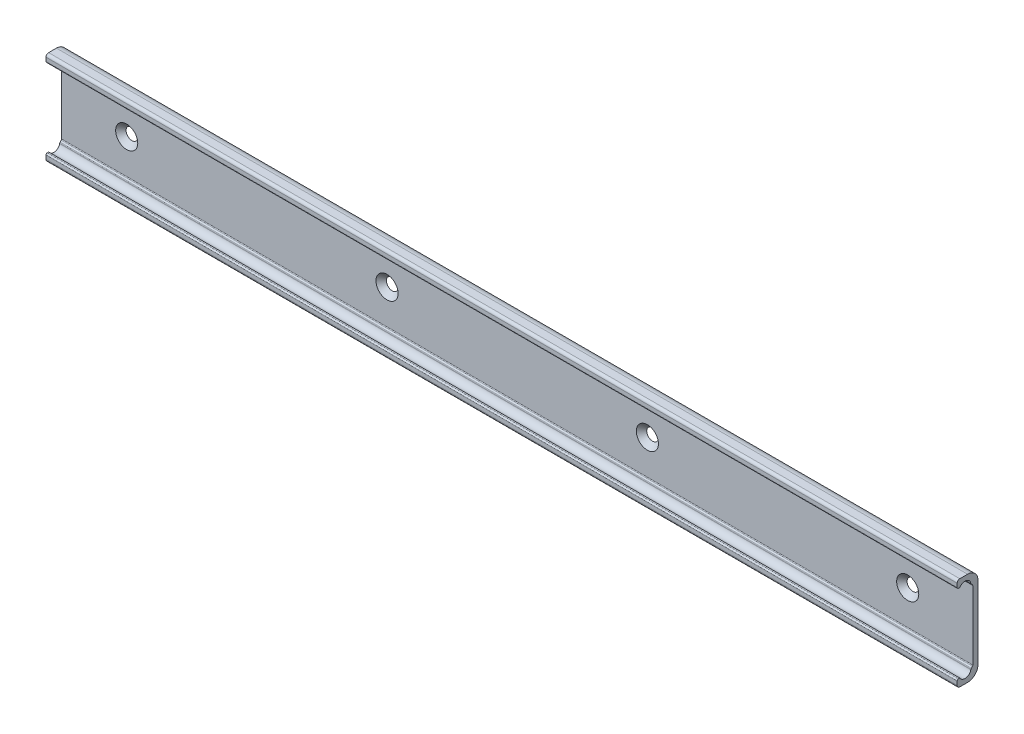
ISO-10303-21;
HEADER;
FILE_DESCRIPTION(('STEP AP214'),'2;1');
FILE_NAME('part.step','',(''),(''),'','','');
FILE_SCHEMA(('AUTOMOTIVE_DESIGN { 1 0 10303 214 1 1 1 1 }'));
ENDSEC;
DATA;
#1=APPLICATION_CONTEXT('core data for automotive mechanical design processes');
#2=APPLICATION_PROTOCOL_DEFINITION('international standard','automotive_design',2000,#1);
#3=PRODUCT_CONTEXT('',#1,'mechanical');
#4=PRODUCT('Part','Part','',(#3));
#5=PRODUCT_RELATED_PRODUCT_CATEGORY('part','',(#4));
#6=PRODUCT_DEFINITION_FORMATION('','',#4);
#7=PRODUCT_DEFINITION_CONTEXT('part definition',#1,'design');
#8=PRODUCT_DEFINITION('design','',#6,#7);
#9=PRODUCT_DEFINITION_SHAPE('','',#8);
#10=(LENGTH_UNIT() NAMED_UNIT(*) SI_UNIT(.MILLI.,.METRE.));
#11=(NAMED_UNIT(*) PLANE_ANGLE_UNIT() SI_UNIT($,.RADIAN.));
#12=(NAMED_UNIT(*) SI_UNIT($,.STERADIAN.) SOLID_ANGLE_UNIT());
#13=UNCERTAINTY_MEASURE_WITH_UNIT(LENGTH_MEASURE(1.E-05),#10,'distance_accuracy_value','');
#14=(GEOMETRIC_REPRESENTATION_CONTEXT(3) GLOBAL_UNCERTAINTY_ASSIGNED_CONTEXT((#13)) GLOBAL_UNIT_ASSIGNED_CONTEXT((#10,
#11,#12)) REPRESENTATION_CONTEXT('',''));
#15=CARTESIAN_POINT('',(0.,0.,0.));
#16=DIRECTION('',(0.,0.,1.));
#17=DIRECTION('',(1.,0.,0.));
#18=AXIS2_PLACEMENT_3D('',#15,#16,#17);
#19=CARTESIAN_POINT('',(325.,14.,4.));
#20=DIRECTION('',(-1.,0.,0.));
#21=DIRECTION('',(0.,0.,1.));
#22=AXIS2_PLACEMENT_3D('',#19,#20,#21);
#23=CYLINDRICAL_SURFACE('',#22,4.);
#24=CARTESIAN_POINT('',(-25.,14.,4.));
#25=DIRECTION('',(-1.,0.,0.));
#26=DIRECTION('',(0.,0.,1.));
#27=AXIS2_PLACEMENT_3D('',#24,#25,#26);
#28=CIRCLE('',#27,4.);
#29=CARTESIAN_POINT('',(-25.,18.,4.));
#30=VERTEX_POINT('',#29);
#31=CARTESIAN_POINT('',(-25.,14.,0.));
#32=VERTEX_POINT('',#31);
#33=EDGE_CURVE('E174',#30,#32,#28,.T.);
#34=ORIENTED_EDGE('',*,*,#33,.F.);
#35=DIRECTION('',(-1.,0.,0.));
#36=VECTOR('',#35,1.);
#37=CARTESIAN_POINT('',(325.,18.,4.));
#38=LINE('',#37,#36);
#39=CARTESIAN_POINT('',(325.,18.,4.));
#40=VERTEX_POINT('',#39);
#41=EDGE_CURVE('E9',#40,#30,#38,.T.);
#42=ORIENTED_EDGE('',*,*,#41,.F.);
#43=CARTESIAN_POINT('',(325.,14.,4.));
#44=DIRECTION('',(-1.,0.,0.));
#45=DIRECTION('',(0.,0.,1.));
#46=AXIS2_PLACEMENT_3D('',#43,#44,#45);
#47=CIRCLE('',#46,4.);
#48=CARTESIAN_POINT('',(325.,14.,0.));
#49=VERTEX_POINT('',#48);
#50=EDGE_CURVE('E176',#40,#49,#47,.T.);
#51=ORIENTED_EDGE('',*,*,#50,.T.);
#52=DIRECTION('',(-1.,0.,0.));
#53=VECTOR('',#52,1.);
#54=CARTESIAN_POINT('',(325.,14.,0.));
#55=LINE('',#54,#53);
#56=EDGE_CURVE('E17',#49,#32,#55,.T.);
#57=ORIENTED_EDGE('',*,*,#56,.T.);
#58=EDGE_LOOP('',(#34,#42,#51,#57));
#59=FACE_BOUND('',#58,.T.);
#60=ADVANCED_FACE('F14',(#59),#23,.T.);
#61=CARTESIAN_POINT('',(325.,18.,7.));
#62=DIRECTION('',(0.,1.,0.));
#63=DIRECTION('',(-1.,0.,0.));
#64=AXIS2_PLACEMENT_3D('',#61,#62,#63);
#65=PLANE('',#64);
#66=DIRECTION('',(0.,0.,-1.));
#67=VECTOR('',#66,1.);
#68=CARTESIAN_POINT('',(-25.,18.,7.));
#69=LINE('',#68,#67);
#70=CARTESIAN_POINT('',(-25.,18.,7.));
#71=VERTEX_POINT('',#70);
#72=EDGE_CURVE('E192',#71,#30,#69,.T.);
#73=ORIENTED_EDGE('',*,*,#72,.F.);
#74=DIRECTION('',(-1.,0.,0.));
#75=VECTOR('',#74,1.);
#76=CARTESIAN_POINT('',(325.,18.,7.));
#77=LINE('',#76,#75);
#78=CARTESIAN_POINT('',(325.,18.,7.));
#79=VERTEX_POINT('',#78);
#80=EDGE_CURVE('E22',#79,#71,#77,.T.);
#81=ORIENTED_EDGE('',*,*,#80,.F.);
#82=DIRECTION('',(0.,0.,-1.));
#83=VECTOR('',#82,1.);
#84=CARTESIAN_POINT('',(325.,18.,7.));
#85=LINE('',#84,#83);
#86=EDGE_CURVE('E181',#79,#40,#85,.T.);
#87=ORIENTED_EDGE('',*,*,#86,.T.);
#88=ORIENTED_EDGE('',*,*,#41,.T.);
#89=EDGE_LOOP('',(#73,#81,#87,#88));
#90=FACE_BOUND('',#89,.T.);
#91=ADVANCED_FACE('F448',(#90),#65,.T.);
#92=CARTESIAN_POINT('',(325.,17.,7.));
#93=DIRECTION('',(-1.,0.,0.));
#94=DIRECTION('',(0.,0.,1.));
#95=AXIS2_PLACEMENT_3D('',#92,#93,#94);
#96=CYLINDRICAL_SURFACE('',#95,1.);
#97=CARTESIAN_POINT('',(-25.,17.,7.));
#98=DIRECTION('',(-1.,0.,0.));
#99=DIRECTION('',(0.,0.,1.));
#100=AXIS2_PLACEMENT_3D('',#97,#98,#99);
#101=CIRCLE('',#100,1.);
#102=CARTESIAN_POINT('',(-25.,17.,8.));
#103=VERTEX_POINT('',#102);
#104=EDGE_CURVE('E258',#103,#71,#101,.T.);
#105=ORIENTED_EDGE('',*,*,#104,.F.);
#106=DIRECTION('',(-1.,0.,0.));
#107=VECTOR('',#106,1.);
#108=CARTESIAN_POINT('',(325.,17.,8.));
#109=LINE('',#108,#107);
#110=CARTESIAN_POINT('',(325.,17.,8.));
#111=VERTEX_POINT('',#110);
#112=EDGE_CURVE('E328',#111,#103,#109,.T.);
#113=ORIENTED_EDGE('',*,*,#112,.F.);
#114=CARTESIAN_POINT('',(325.,17.,7.));
#115=DIRECTION('',(-1.,0.,0.));
#116=DIRECTION('',(0.,0.,1.));
#117=AXIS2_PLACEMENT_3D('',#114,#115,#116);
#118=CIRCLE('',#117,1.);
#119=EDGE_CURVE('E324',#111,#79,#118,.T.);
#120=ORIENTED_EDGE('',*,*,#119,.T.);
#121=ORIENTED_EDGE('',*,*,#80,.T.);
#122=EDGE_LOOP('',(#105,#113,#120,#121));
#123=FACE_BOUND('',#122,.T.);
#124=ADVANCED_FACE('F453',(#123),#96,.T.);
#125=CARTESIAN_POINT('',(325.,15.55,8.));
#126=DIRECTION('',(0.,0.,1.));
#127=DIRECTION('',(1.,0.,0.));
#128=AXIS2_PLACEMENT_3D('',#125,#126,#127);
#129=PLANE('',#128);
#130=DIRECTION('',(0.,1.,0.));
#131=VECTOR('',#130,1.);
#132=CARTESIAN_POINT('',(-25.,15.55,8.));
#133=LINE('',#132,#131);
#134=CARTESIAN_POINT('',(-25.,15.55,8.));
#135=VERTEX_POINT('',#134);
#136=EDGE_CURVE('E255',#135,#103,#133,.T.);
#137=ORIENTED_EDGE('',*,*,#136,.F.);
#138=DIRECTION('',(-1.,0.,0.));
#139=VECTOR('',#138,1.);
#140=CARTESIAN_POINT('',(325.,15.55,8.));
#141=LINE('',#140,#139);
#142=CARTESIAN_POINT('',(325.,15.55,8.));
#143=VERTEX_POINT('',#142);
#144=EDGE_CURVE('E330',#143,#135,#141,.T.);
#145=ORIENTED_EDGE('',*,*,#144,.F.);
#146=DIRECTION('',(0.,1.,0.));
#147=VECTOR('',#146,1.);
#148=CARTESIAN_POINT('',(325.,15.55,8.));
#149=LINE('',#148,#147);
#150=EDGE_CURVE('E321',#143,#111,#149,.T.);
#151=ORIENTED_EDGE('',*,*,#150,.T.);
#152=ORIENTED_EDGE('',*,*,#112,.T.);
#153=EDGE_LOOP('',(#137,#145,#151,#152));
#154=FACE_BOUND('',#153,.T.);
#155=ADVANCED_FACE('F445',(#154),#129,.T.);
#156=CARTESIAN_POINT('',(325.,15.5499998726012,7.5));
#157=DIRECTION('',(-1.,0.,0.));
#158=DIRECTION('',(0.,0.,1.));
#159=AXIS2_PLACEMENT_3D('',#156,#157,#158);
#160=CYLINDRICAL_SURFACE('',#159,0.500000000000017);
#161=CARTESIAN_POINT('',(-25.,15.5499998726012,7.5));
#162=DIRECTION('',(-1.,0.,0.));
#163=DIRECTION('',(0.,0.,1.));
#164=AXIS2_PLACEMENT_3D('',#161,#162,#163);
#165=CIRCLE('',#164,0.500000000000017);
#166=CARTESIAN_POINT('',(-25.,15.0499998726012,7.49999995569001));
#167=VERTEX_POINT('',#166);
#168=EDGE_CURVE('E252',#167,#135,#165,.T.);
#169=ORIENTED_EDGE('',*,*,#168,.F.);
#170=DIRECTION('',(-1.,0.,0.));
#171=VECTOR('',#170,1.);
#172=CARTESIAN_POINT('',(325.,15.0499998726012,7.49999995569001));
#173=LINE('',#172,#171);
#174=CARTESIAN_POINT('',(325.,15.0499998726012,7.49999995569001));
#175=VERTEX_POINT('',#174);
#176=EDGE_CURVE('E332',#175,#167,#173,.T.);
#177=ORIENTED_EDGE('',*,*,#176,.F.);
#178=CARTESIAN_POINT('',(325.,15.5499998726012,7.5));
#179=DIRECTION('',(-1.,0.,0.));
#180=DIRECTION('',(0.,0.,1.));
#181=AXIS2_PLACEMENT_3D('',#178,#179,#180);
#182=CIRCLE('',#181,0.500000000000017);
#183=EDGE_CURVE('E318',#175,#143,#182,.T.);
#184=ORIENTED_EDGE('',*,*,#183,.T.);
#185=ORIENTED_EDGE('',*,*,#144,.T.);
#186=EDGE_LOOP('',(#169,#177,#184,#185));
#187=FACE_BOUND('',#186,.T.);
#188=ADVANCED_FACE('F441',(#187),#160,.T.);
#189=CARTESIAN_POINT('',(325.,15.0499998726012,7.49999995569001));
#190=DIRECTION('',(0.,-1.,0.));
#191=DIRECTION('',(1.,0.,0.));
#192=AXIS2_PLACEMENT_3D('',#189,#190,#191);
#193=PLANE('',#192);
#194=DIRECTION('',(0.,0.,1.));
#195=VECTOR('',#194,1.);
#196=CARTESIAN_POINT('',(-25.,15.0499998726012,7.49999995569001));
#197=LINE('',#196,#195);
#198=CARTESIAN_POINT('',(-25.,15.0499998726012,6.99185845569));
#199=VERTEX_POINT('',#198);
#200=EDGE_CURVE('E249',#199,#167,#197,.T.);
#201=ORIENTED_EDGE('',*,*,#200,.F.);
#202=DIRECTION('',(-1.,0.,0.));
#203=VECTOR('',#202,1.);
#204=CARTESIAN_POINT('',(325.,15.0499998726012,6.99185845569));
#205=LINE('',#204,#203);
#206=CARTESIAN_POINT('',(325.,15.0499998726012,6.99185845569));
#207=VERTEX_POINT('',#206);
#208=EDGE_CURVE('E334',#207,#199,#205,.T.);
#209=ORIENTED_EDGE('',*,*,#208,.F.);
#210=DIRECTION('',(0.,0.,1.));
#211=VECTOR('',#210,1.);
#212=CARTESIAN_POINT('',(325.,15.0499998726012,7.49999995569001));
#213=LINE('',#212,#211);
#214=EDGE_CURVE('E315',#207,#175,#213,.T.);
#215=ORIENTED_EDGE('',*,*,#214,.T.);
#216=ORIENTED_EDGE('',*,*,#176,.T.);
#217=EDGE_LOOP('',(#201,#209,#215,#216));
#218=FACE_BOUND('',#217,.T.);
#219=ADVANCED_FACE('F437',(#218),#193,.T.);
#220=CARTESIAN_POINT('',(325.,13.899999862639,4.99999993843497));
#221=DIRECTION('',(-1.,0.,0.));
#222=DIRECTION('',(0.,0.,1.));
#223=AXIS2_PLACEMENT_3D('',#220,#221,#222);
#224=CYLINDRICAL_SURFACE('',#223,2.30000008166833);
#225=CARTESIAN_POINT('',(-25.,13.899999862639,4.99999993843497));
#226=DIRECTION('',(1.,0.,0.));
#227=DIRECTION('',(0.,0.,1.));
#228=AXIS2_PLACEMENT_3D('',#225,#226,#227);
#229=CIRCLE('',#228,2.30000008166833);
#230=CARTESIAN_POINT('',(-25.,14.3822673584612,2.75112945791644));
#231=VERTEX_POINT('',#230);
#232=EDGE_CURVE('E246',#231,#199,#229,.T.);
#233=ORIENTED_EDGE('',*,*,#232,.F.);
#234=DIRECTION('',(-1.,0.,0.));
#235=VECTOR('',#234,1.);
#236=CARTESIAN_POINT('',(325.,14.3822673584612,2.75112945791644));
#237=LINE('',#236,#235);
#238=CARTESIAN_POINT('',(325.,14.3822673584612,2.75112945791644));
#239=VERTEX_POINT('',#238);
#240=EDGE_CURVE('E336',#239,#231,#237,.T.);
#241=ORIENTED_EDGE('',*,*,#240,.F.);
#242=CARTESIAN_POINT('',(325.,13.899999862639,4.99999993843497));
#243=DIRECTION('',(1.,0.,0.));
#244=DIRECTION('',(0.,0.,1.));
#245=AXIS2_PLACEMENT_3D('',#242,#243,#244);
#246=CIRCLE('',#245,2.30000008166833);
#247=EDGE_CURVE('E312',#239,#207,#246,.T.);
#248=ORIENTED_EDGE('',*,*,#247,.T.);
#249=ORIENTED_EDGE('',*,*,#208,.T.);
#250=EDGE_LOOP('',(#233,#241,#248,#249));
#251=FACE_BOUND('',#250,.T.);
#252=ADVANCED_FACE('F433',(#251),#224,.F.);
#253=CARTESIAN_POINT('',(325.,14.2647621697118,2.72240648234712));
#254=DIRECTION('',(0.,-0.237449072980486,0.971399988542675));
#255=DIRECTION('',(0.,0.971399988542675,0.237449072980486));
#256=AXIS2_PLACEMENT_3D('',#253,#254,#255);
#257=PLANE('',#256);
#258=DIRECTION('',(0.,0.971399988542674,0.237449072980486));
#259=VECTOR('',#258,1.);
#260=CARTESIAN_POINT('',(-25.,14.2647621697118,2.72240648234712));
#261=LINE('',#260,#259);
#262=CARTESIAN_POINT('',(-25.,14.2647621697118,2.72240648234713));
#263=VERTEX_POINT('',#262);
#264=EDGE_CURVE('E243',#263,#231,#261,.T.);
#265=ORIENTED_EDGE('',*,*,#264,.F.);
#266=DIRECTION('',(-1.,0.,0.));
#267=VECTOR('',#266,1.);
#268=CARTESIAN_POINT('',(325.,14.2647621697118,2.72240648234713));
#269=LINE('',#268,#267);
#270=CARTESIAN_POINT('',(325.,14.2647621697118,2.72240648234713));
#271=VERTEX_POINT('',#270);
#272=EDGE_CURVE('E338',#271,#263,#269,.T.);
#273=ORIENTED_EDGE('',*,*,#272,.F.);
#274=DIRECTION('',(0.,0.971399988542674,0.237449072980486));
#275=VECTOR('',#274,1.);
#276=CARTESIAN_POINT('',(325.,14.2647621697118,2.72240648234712));
#277=LINE('',#276,#275);
#278=EDGE_CURVE('E309',#271,#239,#277,.T.);
#279=ORIENTED_EDGE('',*,*,#278,.T.);
#280=ORIENTED_EDGE('',*,*,#240,.T.);
#281=EDGE_LOOP('',(#265,#273,#279,#280));
#282=FACE_BOUND('',#281,.T.);
#283=ADVANCED_FACE('F429',(#282),#257,.T.);
#284=CARTESIAN_POINT('',(325.,14.3343843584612,2.2272774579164));
#285=DIRECTION('',(-1.,0.,0.));
#286=DIRECTION('',(0.,0.,1.));
#287=AXIS2_PLACEMENT_3D('',#284,#285,#286);
#288=CYLINDRICAL_SURFACE('',#287,0.49999999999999);
#289=CARTESIAN_POINT('',(-25.,14.3343843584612,2.2272774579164));
#290=DIRECTION('',(-1.,0.,0.));
#291=DIRECTION('',(0.,0.,1.));
#292=AXIS2_PLACEMENT_3D('',#289,#290,#291);
#293=CIRCLE('',#292,0.49999999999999);
#294=CARTESIAN_POINT('',(-25.,13.980830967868,2.58083084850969));
#295=VERTEX_POINT('',#294);
#296=EDGE_CURVE('E240',#295,#263,#293,.T.);
#297=ORIENTED_EDGE('',*,*,#296,.F.);
#298=DIRECTION('',(-1.,0.,0.));
#299=VECTOR('',#298,1.);
#300=CARTESIAN_POINT('',(325.,13.980830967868,2.58083084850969));
#301=LINE('',#300,#299);
#302=CARTESIAN_POINT('',(325.,13.980830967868,2.58083084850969));
#303=VERTEX_POINT('',#302);
#304=EDGE_CURVE('E340',#303,#295,#301,.T.);
#305=ORIENTED_EDGE('',*,*,#304,.F.);
#306=CARTESIAN_POINT('',(325.,14.3343843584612,2.2272774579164));
#307=DIRECTION('',(-1.,0.,0.));
#308=DIRECTION('',(0.,0.,1.));
#309=AXIS2_PLACEMENT_3D('',#306,#307,#308);
#310=CIRCLE('',#309,0.49999999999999);
#311=EDGE_CURVE('E306',#303,#271,#310,.T.);
#312=ORIENTED_EDGE('',*,*,#311,.T.);
#313=ORIENTED_EDGE('',*,*,#272,.T.);
#314=EDGE_LOOP('',(#297,#305,#312,#313));
#315=FACE_BOUND('',#314,.T.);
#316=ADVANCED_FACE('F425',(#315),#288,.T.);
#317=CARTESIAN_POINT('',(325.,13.5464468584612,2.1464464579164));
#318=DIRECTION('',(0.,-0.707107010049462,0.707106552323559));
#319=DIRECTION('',(0.,0.707106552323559,0.707107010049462));
#320=AXIS2_PLACEMENT_3D('',#317,#318,#319);
#321=PLANE('',#320);
#322=DIRECTION('',(0.,0.707106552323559,0.707107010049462));
#323=VECTOR('',#322,1.);
#324=CARTESIAN_POINT('',(-25.,13.5464468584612,2.1464464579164));
#325=LINE('',#324,#323);
#326=CARTESIAN_POINT('',(-25.,13.5464468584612,2.1464464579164));
#327=VERTEX_POINT('',#326);
#328=EDGE_CURVE('E237',#327,#295,#325,.T.);
#329=ORIENTED_EDGE('',*,*,#328,.F.);
#330=DIRECTION('',(-1.,0.,0.));
#331=VECTOR('',#330,1.);
#332=CARTESIAN_POINT('',(325.,13.5464468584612,2.1464464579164));
#333=LINE('',#332,#331);
#334=CARTESIAN_POINT('',(325.,13.5464468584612,2.1464464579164));
#335=VERTEX_POINT('',#334);
#336=EDGE_CURVE('E342',#335,#327,#333,.T.);
#337=ORIENTED_EDGE('',*,*,#336,.F.);
#338=DIRECTION('',(0.,0.707106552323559,0.707107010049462));
#339=VECTOR('',#338,1.);
#340=CARTESIAN_POINT('',(325.,13.5464468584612,2.1464464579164));
#341=LINE('',#340,#339);
#342=EDGE_CURVE('E303',#335,#303,#341,.T.);
#343=ORIENTED_EDGE('',*,*,#342,.T.);
#344=ORIENTED_EDGE('',*,*,#304,.T.);
#345=EDGE_LOOP('',(#329,#337,#343,#344));
#346=FACE_BOUND('',#345,.T.);
#347=ADVANCED_FACE('F421',(#346),#321,.T.);
#348=CARTESIAN_POINT('',(325.,13.1928934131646,2.49999990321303));
#349=DIRECTION('',(-1.,0.,0.));
#350=DIRECTION('',(0.,0.,1.));
#351=AXIS2_PLACEMENT_3D('',#348,#349,#350);
#352=CYLINDRICAL_SURFACE('',#351,0.500000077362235);
#353=CARTESIAN_POINT('',(-25.,13.1928934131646,2.49999990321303));
#354=DIRECTION('',(1.,0.,0.));
#355=DIRECTION('',(0.,0.,1.));
#356=AXIS2_PLACEMENT_3D('',#353,#354,#355);
#357=CIRCLE('',#356,0.500000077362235);
#358=CARTESIAN_POINT('',(-25.,13.1928934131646,1.9999998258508));
#359=VERTEX_POINT('',#358);
#360=EDGE_CURVE('E234',#359,#327,#357,.T.);
#361=ORIENTED_EDGE('',*,*,#360,.F.);
#362=DIRECTION('',(-1.,0.,0.));
#363=VECTOR('',#362,1.);
#364=CARTESIAN_POINT('',(325.,13.1928934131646,1.9999998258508));
#365=LINE('',#364,#363);
#366=CARTESIAN_POINT('',(325.,13.1928934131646,1.9999998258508));
#367=VERTEX_POINT('',#366);
#368=EDGE_CURVE('E344',#367,#359,#365,.T.);
#369=ORIENTED_EDGE('',*,*,#368,.F.);
#370=CARTESIAN_POINT('',(325.,13.1928934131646,2.49999990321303));
#371=DIRECTION('',(1.,0.,0.));
#372=DIRECTION('',(0.,0.,1.));
#373=AXIS2_PLACEMENT_3D('',#370,#371,#372);
#374=CIRCLE('',#373,0.500000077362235);
#375=EDGE_CURVE('E300',#367,#335,#374,.T.);
#376=ORIENTED_EDGE('',*,*,#375,.T.);
#377=ORIENTED_EDGE('',*,*,#336,.T.);
#378=EDGE_LOOP('',(#361,#369,#376,#377));
#379=FACE_BOUND('',#378,.T.);
#380=ADVANCED_FACE('F417',(#379),#352,.F.);
#381=CARTESIAN_POINT('',(325.,-13.1928934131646,1.9999998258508));
#382=DIRECTION('',(0.,0.,1.));
#383=DIRECTION('',(0.,1.,0.));
#384=AXIS2_PLACEMENT_3D('',#381,#382,#383);
#385=PLANE('',#384);
#386=CARTESIAN_POINT('',(300.,0.,1.9999998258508));
#387=DIRECTION('',(0.,0.,1.));
#388=DIRECTION('',(0.,1.,0.));
#389=AXIS2_PLACEMENT_3D('',#386,#387,#388);
#390=CIRCLE('',#389,4.25);
#391=CARTESIAN_POINT('',(300.,4.25,1.99999982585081));
#392=VERTEX_POINT('',#391);
#393=EDGE_CURVE('E712',#392,#392,#390,.T.);
#394=ORIENTED_EDGE('',*,*,#393,.F.);
#395=EDGE_LOOP('',(#394));
#396=FACE_BOUND('',#395,.T.);
#397=CARTESIAN_POINT('',(200.,0.,1.9999998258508));
#398=DIRECTION('',(0.,0.,1.));
#399=DIRECTION('',(0.,1.,0.));
#400=AXIS2_PLACEMENT_3D('',#397,#398,#399);
#401=CIRCLE('',#400,4.25);
#402=CARTESIAN_POINT('',(200.,4.25,1.99999982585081));
#403=VERTEX_POINT('',#402);
#404=EDGE_CURVE('E716',#403,#403,#401,.T.);
#405=ORIENTED_EDGE('',*,*,#404,.F.);
#406=EDGE_LOOP('',(#405));
#407=FACE_BOUND('',#406,.T.);
#408=CARTESIAN_POINT('',(100.,0.,1.9999998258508));
#409=DIRECTION('',(0.,0.,1.));
#410=DIRECTION('',(0.,1.,0.));
#411=AXIS2_PLACEMENT_3D('',#408,#409,#410);
#412=CIRCLE('',#411,4.25);
#413=CARTESIAN_POINT('',(100.,4.25,1.99999982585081));
#414=VERTEX_POINT('',#413);
#415=EDGE_CURVE('E725',#414,#414,#412,.T.);
#416=ORIENTED_EDGE('',*,*,#415,.F.);
#417=EDGE_LOOP('',(#416));
#418=FACE_BOUND('',#417,.T.);
#419=CARTESIAN_POINT('',(0.,0.,1.9999998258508));
#420=DIRECTION('',(0.,0.,1.));
#421=DIRECTION('',(0.,1.,0.));
#422=AXIS2_PLACEMENT_3D('',#419,#420,#421);
#423=CIRCLE('',#422,4.25);
#424=CARTESIAN_POINT('',(0.,4.25,1.99999982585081));
#425=VERTEX_POINT('',#424);
#426=EDGE_CURVE('E196',#425,#425,#423,.T.);
#427=ORIENTED_EDGE('',*,*,#426,.F.);
#428=EDGE_LOOP('',(#427));
#429=FACE_BOUND('',#428,.T.);
#430=DIRECTION('',(0.,1.,0.));
#431=VECTOR('',#430,1.);
#432=CARTESIAN_POINT('',(-25.,-13.1928934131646,1.9999998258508));
#433=LINE('',#432,#431);
#434=CARTESIAN_POINT('',(-25.,-13.1928934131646,1.9999998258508));
#435=VERTEX_POINT('',#434);
#436=EDGE_CURVE('E231',#435,#359,#433,.T.);
#437=ORIENTED_EDGE('',*,*,#436,.F.);
#438=DIRECTION('',(-1.,0.,0.));
#439=VECTOR('',#438,1.);
#440=CARTESIAN_POINT('',(325.,-13.1928934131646,1.9999998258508));
#441=LINE('',#440,#439);
#442=CARTESIAN_POINT('',(325.,-13.1928934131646,1.9999998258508));
#443=VERTEX_POINT('',#442);
#444=EDGE_CURVE('E346',#443,#435,#441,.T.);
#445=ORIENTED_EDGE('',*,*,#444,.F.);
#446=DIRECTION('',(0.,1.,0.));
#447=VECTOR('',#446,1.);
#448=CARTESIAN_POINT('',(325.,-13.1928934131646,1.9999998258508));
#449=LINE('',#448,#447);
#450=EDGE_CURVE('E297',#443,#367,#449,.T.);
#451=ORIENTED_EDGE('',*,*,#450,.T.);
#452=ORIENTED_EDGE('',*,*,#368,.T.);
#453=EDGE_LOOP('',(#437,#445,#451,#452));
#454=FACE_BOUND('',#453,.T.);
#455=ADVANCED_FACE('F413',(#396,#407,#418,#429,#454),#385,.T.);
#456=CARTESIAN_POINT('',(325.,-13.1928934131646,2.49999990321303));
#457=DIRECTION('',(-1.,0.,0.));
#458=DIRECTION('',(0.,0.,1.));
#459=AXIS2_PLACEMENT_3D('',#456,#457,#458);
#460=CYLINDRICAL_SURFACE('',#459,0.500000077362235);
#461=CARTESIAN_POINT('',(-25.,-13.1928934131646,2.49999990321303));
#462=DIRECTION('',(1.,0.,0.));
#463=DIRECTION('',(0.,0.,-1.));
#464=AXIS2_PLACEMENT_3D('',#461,#462,#463);
#465=CIRCLE('',#464,0.500000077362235);
#466=CARTESIAN_POINT('',(-25.,-13.5464468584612,2.1464464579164));
#467=VERTEX_POINT('',#466);
#468=EDGE_CURVE('E228',#467,#435,#465,.T.);
#469=ORIENTED_EDGE('',*,*,#468,.F.);
#470=DIRECTION('',(-1.,0.,0.));
#471=VECTOR('',#470,1.);
#472=CARTESIAN_POINT('',(325.,-13.5464468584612,2.1464464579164));
#473=LINE('',#472,#471);
#474=CARTESIAN_POINT('',(325.,-13.5464468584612,2.1464464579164));
#475=VERTEX_POINT('',#474);
#476=EDGE_CURVE('E348',#475,#467,#473,.T.);
#477=ORIENTED_EDGE('',*,*,#476,.F.);
#478=CARTESIAN_POINT('',(325.,-13.1928934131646,2.49999990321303));
#479=DIRECTION('',(1.,0.,0.));
#480=DIRECTION('',(0.,0.,-1.));
#481=AXIS2_PLACEMENT_3D('',#478,#479,#480);
#482=CIRCLE('',#481,0.500000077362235);
#483=EDGE_CURVE('E294',#475,#443,#482,.T.);
#484=ORIENTED_EDGE('',*,*,#483,.T.);
#485=ORIENTED_EDGE('',*,*,#444,.T.);
#486=EDGE_LOOP('',(#469,#477,#484,#485));
#487=FACE_BOUND('',#486,.T.);
#488=ADVANCED_FACE('F409',(#487),#460,.F.);
#489=CARTESIAN_POINT('',(325.,-13.5464468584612,2.1464464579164));
#490=DIRECTION('',(0.,0.707107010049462,0.707106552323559));
#491=DIRECTION('',(0.,0.707106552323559,-0.707107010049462));
#492=AXIS2_PLACEMENT_3D('',#489,#490,#491);
#493=PLANE('',#492);
#494=DIRECTION('',(0.,0.707106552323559,-0.707107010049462));
#495=VECTOR('',#494,1.);
#496=CARTESIAN_POINT('',(-25.,-13.5464468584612,2.1464464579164));
#497=LINE('',#496,#495);
#498=CARTESIAN_POINT('',(-25.,-13.980830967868,2.58083084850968));
#499=VERTEX_POINT('',#498);
#500=EDGE_CURVE('E225',#499,#467,#497,.T.);
#501=ORIENTED_EDGE('',*,*,#500,.F.);
#502=DIRECTION('',(-1.,0.,0.));
#503=VECTOR('',#502,1.);
#504=CARTESIAN_POINT('',(325.,-13.980830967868,2.58083084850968));
#505=LINE('',#504,#503);
#506=CARTESIAN_POINT('',(325.,-13.980830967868,2.58083084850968));
#507=VERTEX_POINT('',#506);
#508=EDGE_CURVE('E350',#507,#499,#505,.T.);
#509=ORIENTED_EDGE('',*,*,#508,.F.);
#510=DIRECTION('',(0.,0.707106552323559,-0.707107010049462));
#511=VECTOR('',#510,1.);
#512=CARTESIAN_POINT('',(325.,-13.5464468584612,2.1464464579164));
#513=LINE('',#512,#511);
#514=EDGE_CURVE('E291',#507,#475,#513,.T.);
#515=ORIENTED_EDGE('',*,*,#514,.T.);
#516=ORIENTED_EDGE('',*,*,#476,.T.);
#517=EDGE_LOOP('',(#501,#509,#515,#516));
#518=FACE_BOUND('',#517,.T.);
#519=ADVANCED_FACE('F405',(#518),#493,.T.);
#520=CARTESIAN_POINT('',(325.,-14.3343843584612,2.22727745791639));
#521=DIRECTION('',(-1.,0.,0.));
#522=DIRECTION('',(0.,0.,1.));
#523=AXIS2_PLACEMENT_3D('',#520,#521,#522);
#524=CYLINDRICAL_SURFACE('',#523,0.49999999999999);
#525=CARTESIAN_POINT('',(-25.,-14.3343843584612,2.22727745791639));
#526=DIRECTION('',(-1.,0.,0.));
#527=DIRECTION('',(0.,0.,-1.));
#528=AXIS2_PLACEMENT_3D('',#525,#526,#527);
#529=CIRCLE('',#528,0.49999999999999);
#530=CARTESIAN_POINT('',(-25.,-14.2647621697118,2.72240648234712));
#531=VERTEX_POINT('',#530);
#532=EDGE_CURVE('E222',#531,#499,#529,.T.);
#533=ORIENTED_EDGE('',*,*,#532,.F.);
#534=DIRECTION('',(-1.,0.,0.));
#535=VECTOR('',#534,1.);
#536=CARTESIAN_POINT('',(325.,-14.2647621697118,2.72240648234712));
#537=LINE('',#536,#535);
#538=CARTESIAN_POINT('',(325.,-14.2647621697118,2.72240648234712));
#539=VERTEX_POINT('',#538);
#540=EDGE_CURVE('E352',#539,#531,#537,.T.);
#541=ORIENTED_EDGE('',*,*,#540,.F.);
#542=CARTESIAN_POINT('',(325.,-14.3343843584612,2.22727745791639));
#543=DIRECTION('',(-1.,0.,0.));
#544=DIRECTION('',(0.,0.,-1.));
#545=AXIS2_PLACEMENT_3D('',#542,#543,#544);
#546=CIRCLE('',#545,0.49999999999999);
#547=EDGE_CURVE('E288',#539,#507,#546,.T.);
#548=ORIENTED_EDGE('',*,*,#547,.T.);
#549=ORIENTED_EDGE('',*,*,#508,.T.);
#550=EDGE_LOOP('',(#533,#541,#548,#549));
#551=FACE_BOUND('',#550,.T.);
#552=ADVANCED_FACE('F401',(#551),#524,.T.);
#553=CARTESIAN_POINT('',(325.,-14.2647621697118,2.72240648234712));
#554=DIRECTION('',(0.,0.237449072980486,0.971399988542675));
#555=DIRECTION('',(0.,0.971399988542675,-0.237449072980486));
#556=AXIS2_PLACEMENT_3D('',#553,#554,#555);
#557=PLANE('',#556);
#558=DIRECTION('',(0.,0.971399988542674,-0.237449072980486));
#559=VECTOR('',#558,1.);
#560=CARTESIAN_POINT('',(-25.,-14.2647621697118,2.72240648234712));
#561=LINE('',#560,#559);
#562=CARTESIAN_POINT('',(-25.,-14.3822673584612,2.75112945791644));
#563=VERTEX_POINT('',#562);
#564=EDGE_CURVE('E219',#563,#531,#561,.T.);
#565=ORIENTED_EDGE('',*,*,#564,.F.);
#566=DIRECTION('',(-1.,0.,0.));
#567=VECTOR('',#566,1.);
#568=CARTESIAN_POINT('',(325.,-14.3822673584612,2.75112945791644));
#569=LINE('',#568,#567);
#570=CARTESIAN_POINT('',(325.,-14.3822673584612,2.75112945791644));
#571=VERTEX_POINT('',#570);
#572=EDGE_CURVE('E354',#571,#563,#569,.T.);
#573=ORIENTED_EDGE('',*,*,#572,.F.);
#574=DIRECTION('',(0.,0.971399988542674,-0.237449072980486));
#575=VECTOR('',#574,1.);
#576=CARTESIAN_POINT('',(325.,-14.2647621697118,2.72240648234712));
#577=LINE('',#576,#575);
#578=EDGE_CURVE('E285',#571,#539,#577,.T.);
#579=ORIENTED_EDGE('',*,*,#578,.T.);
#580=ORIENTED_EDGE('',*,*,#540,.T.);
#581=EDGE_LOOP('',(#565,#573,#579,#580));
#582=FACE_BOUND('',#581,.T.);
#583=ADVANCED_FACE('F397',(#582),#557,.T.);
#584=CARTESIAN_POINT('',(325.,-13.899999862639,4.99999993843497));
#585=DIRECTION('',(-1.,0.,0.));
#586=DIRECTION('',(0.,0.,1.));
#587=AXIS2_PLACEMENT_3D('',#584,#585,#586);
#588=CYLINDRICAL_SURFACE('',#587,2.30000008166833);
#589=CARTESIAN_POINT('',(-25.,-13.899999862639,4.99999993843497));
#590=DIRECTION('',(1.,0.,0.));
#591=DIRECTION('',(0.,0.,-1.));
#592=AXIS2_PLACEMENT_3D('',#589,#590,#591);
#593=CIRCLE('',#592,2.30000008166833);
#594=CARTESIAN_POINT('',(-25.,-15.0499998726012,6.99185845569));
#595=VERTEX_POINT('',#594);
#596=EDGE_CURVE('E216',#595,#563,#593,.T.);
#597=ORIENTED_EDGE('',*,*,#596,.F.);
#598=DIRECTION('',(-1.,0.,0.));
#599=VECTOR('',#598,1.);
#600=CARTESIAN_POINT('',(325.,-15.0499998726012,6.99185845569));
#601=LINE('',#600,#599);
#602=CARTESIAN_POINT('',(325.,-15.0499998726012,6.99185845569));
#603=VERTEX_POINT('',#602);
#604=EDGE_CURVE('E356',#603,#595,#601,.T.);
#605=ORIENTED_EDGE('',*,*,#604,.F.);
#606=CARTESIAN_POINT('',(325.,-13.899999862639,4.99999993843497));
#607=DIRECTION('',(1.,0.,0.));
#608=DIRECTION('',(0.,0.,-1.));
#609=AXIS2_PLACEMENT_3D('',#606,#607,#608);
#610=CIRCLE('',#609,2.30000008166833);
#611=EDGE_CURVE('E282',#603,#571,#610,.T.);
#612=ORIENTED_EDGE('',*,*,#611,.T.);
#613=ORIENTED_EDGE('',*,*,#572,.T.);
#614=EDGE_LOOP('',(#597,#605,#612,#613));
#615=FACE_BOUND('',#614,.T.);
#616=ADVANCED_FACE('F393',(#615),#588,.F.);
#617=CARTESIAN_POINT('',(325.,-15.0499998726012,7.49999995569));
#618=DIRECTION('',(0.,1.,0.));
#619=DIRECTION('',(-1.,0.,0.));
#620=AXIS2_PLACEMENT_3D('',#617,#618,#619);
#621=PLANE('',#620);
#622=DIRECTION('',(0.,0.,-1.));
#623=VECTOR('',#622,1.);
#624=CARTESIAN_POINT('',(-25.,-15.0499998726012,7.49999995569));
#625=LINE('',#624,#623);
#626=CARTESIAN_POINT('',(-25.,-15.0499998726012,7.49999995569));
#627=VERTEX_POINT('',#626);
#628=EDGE_CURVE('E213',#627,#595,#625,.T.);
#629=ORIENTED_EDGE('',*,*,#628,.F.);
#630=DIRECTION('',(-1.,0.,0.));
#631=VECTOR('',#630,1.);
#632=CARTESIAN_POINT('',(325.,-15.0499998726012,7.49999995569));
#633=LINE('',#632,#631);
#634=CARTESIAN_POINT('',(325.,-15.0499998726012,7.49999995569));
#635=VERTEX_POINT('',#634);
#636=EDGE_CURVE('E358',#635,#627,#633,.T.);
#637=ORIENTED_EDGE('',*,*,#636,.F.);
#638=DIRECTION('',(0.,0.,-1.));
#639=VECTOR('',#638,1.);
#640=CARTESIAN_POINT('',(325.,-15.0499998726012,7.49999995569));
#641=LINE('',#640,#639);
#642=EDGE_CURVE('E279',#635,#603,#641,.T.);
#643=ORIENTED_EDGE('',*,*,#642,.T.);
#644=ORIENTED_EDGE('',*,*,#604,.T.);
#645=EDGE_LOOP('',(#629,#637,#643,#644));
#646=FACE_BOUND('',#645,.T.);
#647=ADVANCED_FACE('F389',(#646),#621,.T.);
#648=CARTESIAN_POINT('',(325.,-15.5499998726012,7.5));
#649=DIRECTION('',(-1.,0.,0.));
#650=DIRECTION('',(0.,0.,1.));
#651=AXIS2_PLACEMENT_3D('',#648,#649,#650);
#652=CYLINDRICAL_SURFACE('',#651,0.500000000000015);
#653=CARTESIAN_POINT('',(-25.,-15.5499998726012,7.5));
#654=DIRECTION('',(-1.,0.,0.));
#655=DIRECTION('',(0.,0.,-1.));
#656=AXIS2_PLACEMENT_3D('',#653,#654,#655);
#657=CIRCLE('',#656,0.500000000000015);
#658=CARTESIAN_POINT('',(-25.,-15.55,8.));
#659=VERTEX_POINT('',#658);
#660=EDGE_CURVE('E210',#659,#627,#657,.T.);
#661=ORIENTED_EDGE('',*,*,#660,.F.);
#662=DIRECTION('',(-1.,0.,0.));
#663=VECTOR('',#662,1.);
#664=CARTESIAN_POINT('',(325.,-15.55,8.));
#665=LINE('',#664,#663);
#666=CARTESIAN_POINT('',(325.,-15.55,8.));
#667=VERTEX_POINT('',#666);
#668=EDGE_CURVE('E360',#667,#659,#665,.T.);
#669=ORIENTED_EDGE('',*,*,#668,.F.);
#670=CARTESIAN_POINT('',(325.,-15.5499998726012,7.5));
#671=DIRECTION('',(-1.,0.,0.));
#672=DIRECTION('',(0.,0.,-1.));
#673=AXIS2_PLACEMENT_3D('',#670,#671,#672);
#674=CIRCLE('',#673,0.500000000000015);
#675=EDGE_CURVE('E276',#667,#635,#674,.T.);
#676=ORIENTED_EDGE('',*,*,#675,.T.);
#677=ORIENTED_EDGE('',*,*,#636,.T.);
#678=EDGE_LOOP('',(#661,#669,#676,#677));
#679=FACE_BOUND('',#678,.T.);
#680=ADVANCED_FACE('F385',(#679),#652,.T.);
#681=CARTESIAN_POINT('',(325.,-15.55,8.));
#682=DIRECTION('',(0.,0.,1.));
#683=DIRECTION('',(1.,0.,0.));
#684=AXIS2_PLACEMENT_3D('',#681,#682,#683);
#685=PLANE('',#684);
#686=DIRECTION('',(0.,1.,0.));
#687=VECTOR('',#686,1.);
#688=CARTESIAN_POINT('',(-25.,-15.55,8.));
#689=LINE('',#688,#687);
#690=CARTESIAN_POINT('',(-25.,-17.,8.));
#691=VERTEX_POINT('',#690);
#692=EDGE_CURVE('E207',#691,#659,#689,.T.);
#693=ORIENTED_EDGE('',*,*,#692,.F.);
#694=DIRECTION('',(-1.,0.,0.));
#695=VECTOR('',#694,1.);
#696=CARTESIAN_POINT('',(325.,-17.,8.));
#697=LINE('',#696,#695);
#698=CARTESIAN_POINT('',(325.,-17.,8.));
#699=VERTEX_POINT('',#698);
#700=EDGE_CURVE('E362',#699,#691,#697,.T.);
#701=ORIENTED_EDGE('',*,*,#700,.F.);
#702=DIRECTION('',(0.,1.,0.));
#703=VECTOR('',#702,1.);
#704=CARTESIAN_POINT('',(325.,-15.55,8.));
#705=LINE('',#704,#703);
#706=EDGE_CURVE('E273',#699,#667,#705,.T.);
#707=ORIENTED_EDGE('',*,*,#706,.T.);
#708=ORIENTED_EDGE('',*,*,#668,.T.);
#709=EDGE_LOOP('',(#693,#701,#707,#708));
#710=FACE_BOUND('',#709,.T.);
#711=ADVANCED_FACE('F381',(#710),#685,.T.);
#712=CARTESIAN_POINT('',(325.,-17.,7.));
#713=DIRECTION('',(-1.,0.,0.));
#714=DIRECTION('',(0.,0.,1.));
#715=AXIS2_PLACEMENT_3D('',#712,#713,#714);
#716=CYLINDRICAL_SURFACE('',#715,1.);
#717=CARTESIAN_POINT('',(-25.,-17.,7.));
#718=DIRECTION('',(-1.,0.,0.));
#719=DIRECTION('',(0.,0.,-1.));
#720=AXIS2_PLACEMENT_3D('',#717,#718,#719);
#721=CIRCLE('',#720,1.);
#722=CARTESIAN_POINT('',(-25.,-18.,7.));
#723=VERTEX_POINT('',#722);
#724=EDGE_CURVE('E204',#723,#691,#721,.T.);
#725=ORIENTED_EDGE('',*,*,#724,.F.);
#726=DIRECTION('',(-1.,0.,0.));
#727=VECTOR('',#726,1.);
#728=CARTESIAN_POINT('',(325.,-18.,7.));
#729=LINE('',#728,#727);
#730=CARTESIAN_POINT('',(325.,-18.,7.));
#731=VERTEX_POINT('',#730);
#732=EDGE_CURVE('E364',#731,#723,#729,.T.);
#733=ORIENTED_EDGE('',*,*,#732,.F.);
#734=CARTESIAN_POINT('',(325.,-17.,7.));
#735=DIRECTION('',(-1.,0.,0.));
#736=DIRECTION('',(0.,0.,-1.));
#737=AXIS2_PLACEMENT_3D('',#734,#735,#736);
#738=CIRCLE('',#737,1.);
#739=EDGE_CURVE('E270',#731,#699,#738,.T.);
#740=ORIENTED_EDGE('',*,*,#739,.T.);
#741=ORIENTED_EDGE('',*,*,#700,.T.);
#742=EDGE_LOOP('',(#725,#733,#740,#741));
#743=FACE_BOUND('',#742,.T.);
#744=ADVANCED_FACE('F377',(#743),#716,.T.);
#745=CARTESIAN_POINT('',(325.,-18.,7.));
#746=DIRECTION('',(0.,-1.,0.));
#747=DIRECTION('',(1.,0.,0.));
#748=AXIS2_PLACEMENT_3D('',#745,#746,#747);
#749=PLANE('',#748);
#750=DIRECTION('',(0.,0.,1.));
#751=VECTOR('',#750,1.);
#752=CARTESIAN_POINT('',(-25.,-18.,7.));
#753=LINE('',#752,#751);
#754=CARTESIAN_POINT('',(-25.,-18.,4.));
#755=VERTEX_POINT('',#754);
#756=EDGE_CURVE('E201',#755,#723,#753,.T.);
#757=ORIENTED_EDGE('',*,*,#756,.F.);
#758=DIRECTION('',(-1.,0.,0.));
#759=VECTOR('',#758,1.);
#760=CARTESIAN_POINT('',(325.,-18.,4.));
#761=LINE('',#760,#759);
#762=CARTESIAN_POINT('',(325.,-18.,4.));
#763=VERTEX_POINT('',#762);
#764=EDGE_CURVE('E366',#763,#755,#761,.T.);
#765=ORIENTED_EDGE('',*,*,#764,.F.);
#766=DIRECTION('',(0.,0.,1.));
#767=VECTOR('',#766,1.);
#768=CARTESIAN_POINT('',(325.,-18.,7.));
#769=LINE('',#768,#767);
#770=EDGE_CURVE('E267',#763,#731,#769,.T.);
#771=ORIENTED_EDGE('',*,*,#770,.T.);
#772=ORIENTED_EDGE('',*,*,#732,.T.);
#773=EDGE_LOOP('',(#757,#765,#771,#772));
#774=FACE_BOUND('',#773,.T.);
#775=ADVANCED_FACE('F373',(#774),#749,.T.);
#776=CARTESIAN_POINT('',(325.,-14.,4.));
#777=DIRECTION('',(-1.,0.,0.));
#778=DIRECTION('',(0.,0.,1.));
#779=AXIS2_PLACEMENT_3D('',#776,#777,#778);
#780=CYLINDRICAL_SURFACE('',#779,4.);
#781=CARTESIAN_POINT('',(-25.,-14.,4.));
#782=DIRECTION('',(-1.,0.,0.));
#783=DIRECTION('',(0.,0.,-1.));
#784=AXIS2_PLACEMENT_3D('',#781,#782,#783);
#785=CIRCLE('',#784,4.);
#786=CARTESIAN_POINT('',(-25.,-14.,0.));
#787=VERTEX_POINT('',#786);
#788=EDGE_CURVE('E188',#787,#755,#785,.T.);
#789=ORIENTED_EDGE('',*,*,#788,.F.);
#790=DIRECTION('',(-1.,0.,0.));
#791=VECTOR('',#790,1.);
#792=CARTESIAN_POINT('',(325.,-14.,0.));
#793=LINE('',#792,#791);
#794=CARTESIAN_POINT('',(325.,-14.,0.));
#795=VERTEX_POINT('',#794);
#796=EDGE_CURVE('E180',#795,#787,#793,.T.);
#797=ORIENTED_EDGE('',*,*,#796,.F.);
#798=CARTESIAN_POINT('',(325.,-14.,4.));
#799=DIRECTION('',(-1.,0.,0.));
#800=DIRECTION('',(0.,0.,-1.));
#801=AXIS2_PLACEMENT_3D('',#798,#799,#800);
#802=CIRCLE('',#801,4.);
#803=EDGE_CURVE('E264',#795,#763,#802,.T.);
#804=ORIENTED_EDGE('',*,*,#803,.T.);
#805=ORIENTED_EDGE('',*,*,#764,.T.);
#806=EDGE_LOOP('',(#789,#797,#804,#805));
#807=FACE_BOUND('',#806,.T.);
#808=ADVANCED_FACE('F369',(#807),#780,.T.);
#809=CARTESIAN_POINT('',(325.,-14.,0.));
#810=DIRECTION('',(0.,0.,-1.));
#811=DIRECTION('',(-1.,0.,0.));
#812=AXIS2_PLACEMENT_3D('',#809,#810,#811);
#813=PLANE('',#812);
#814=CARTESIAN_POINT('',(300.,0.,-1.74149182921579E-07));
#815=DIRECTION('',(0.,0.,1.));
#816=DIRECTION('',(0.,1.,0.));
#817=AXIS2_PLACEMENT_3D('',#814,#815,#816);
#818=CIRCLE('',#817,2.25);
#819=CARTESIAN_POINT('',(300.,2.25,-1.74149182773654E-07));
#820=VERTEX_POINT('',#819);
#821=EDGE_CURVE('E715',#820,#820,#818,.T.);
#822=ORIENTED_EDGE('',*,*,#821,.T.);
#823=EDGE_LOOP('',(#822));
#824=FACE_BOUND('',#823,.T.);
#825=CARTESIAN_POINT('',(200.,0.,-1.74149182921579E-07));
#826=DIRECTION('',(0.,0.,1.));
#827=DIRECTION('',(0.,1.,0.));
#828=AXIS2_PLACEMENT_3D('',#825,#826,#827);
#829=CIRCLE('',#828,2.25);
#830=CARTESIAN_POINT('',(200.,2.25,-1.74149182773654E-07));
#831=VERTEX_POINT('',#830);
#832=EDGE_CURVE('E719',#831,#831,#829,.T.);
#833=ORIENTED_EDGE('',*,*,#832,.T.);
#834=EDGE_LOOP('',(#833));
#835=FACE_BOUND('',#834,.T.);
#836=CARTESIAN_POINT('',(100.,0.,-1.74149182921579E-07));
#837=DIRECTION('',(0.,0.,1.));
#838=DIRECTION('',(0.,1.,0.));
#839=AXIS2_PLACEMENT_3D('',#836,#837,#838);
#840=CIRCLE('',#839,2.25);
#841=CARTESIAN_POINT('',(100.,2.25,-1.74149182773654E-07));
#842=VERTEX_POINT('',#841);
#843=EDGE_CURVE('E728',#842,#842,#840,.T.);
#844=ORIENTED_EDGE('',*,*,#843,.T.);
#845=EDGE_LOOP('',(#844));
#846=FACE_BOUND('',#845,.T.);
#847=CARTESIAN_POINT('',(0.,0.,-1.74149182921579E-07));
#848=DIRECTION('',(0.,0.,1.));
#849=DIRECTION('',(0.,1.,0.));
#850=AXIS2_PLACEMENT_3D('',#847,#848,#849);
#851=CIRCLE('',#850,2.25);
#852=CARTESIAN_POINT('',(0.,2.25,-1.74149182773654E-07));
#853=VERTEX_POINT('',#852);
#854=EDGE_CURVE('E193',#853,#853,#851,.T.);
#855=ORIENTED_EDGE('',*,*,#854,.T.);
#856=EDGE_LOOP('',(#855));
#857=FACE_BOUND('',#856,.T.);
#858=DIRECTION('',(0.,-1.,0.));
#859=VECTOR('',#858,1.);
#860=CARTESIAN_POINT('',(-25.,-14.,0.));
#861=LINE('',#860,#859);
#862=EDGE_CURVE('E183',#32,#787,#861,.T.);
#863=ORIENTED_EDGE('',*,*,#862,.F.);
#864=ORIENTED_EDGE('',*,*,#56,.F.);
#865=DIRECTION('',(0.,-1.,0.));
#866=VECTOR('',#865,1.);
#867=CARTESIAN_POINT('',(325.,-14.,0.));
#868=LINE('',#867,#866);
#869=EDGE_CURVE('E262',#49,#795,#868,.T.);
#870=ORIENTED_EDGE('',*,*,#869,.T.);
#871=ORIENTED_EDGE('',*,*,#796,.T.);
#872=EDGE_LOOP('',(#863,#864,#870,#871));
#873=FACE_BOUND('',#872,.T.);
#874=ADVANCED_FACE('F184',(#824,#835,#846,#857,#873),#813,.T.);
#875=CARTESIAN_POINT('',(325.,14.,4.));
#876=DIRECTION('',(-1.,0.,0.));
#877=DIRECTION('',(0.,0.,1.));
#878=AXIS2_PLACEMENT_3D('',#875,#876,#877);
#879=PLANE('',#878);
#880=ORIENTED_EDGE('',*,*,#50,.F.);
#881=ORIENTED_EDGE('',*,*,#86,.F.);
#882=ORIENTED_EDGE('',*,*,#119,.F.);
#883=ORIENTED_EDGE('',*,*,#150,.F.);
#884=ORIENTED_EDGE('',*,*,#183,.F.);
#885=ORIENTED_EDGE('',*,*,#214,.F.);
#886=ORIENTED_EDGE('',*,*,#247,.F.);
#887=ORIENTED_EDGE('',*,*,#278,.F.);
#888=ORIENTED_EDGE('',*,*,#311,.F.);
#889=ORIENTED_EDGE('',*,*,#342,.F.);
#890=ORIENTED_EDGE('',*,*,#375,.F.);
#891=ORIENTED_EDGE('',*,*,#450,.F.);
#892=ORIENTED_EDGE('',*,*,#483,.F.);
#893=ORIENTED_EDGE('',*,*,#514,.F.);
#894=ORIENTED_EDGE('',*,*,#547,.F.);
#895=ORIENTED_EDGE('',*,*,#578,.F.);
#896=ORIENTED_EDGE('',*,*,#611,.F.);
#897=ORIENTED_EDGE('',*,*,#642,.F.);
#898=ORIENTED_EDGE('',*,*,#675,.F.);
#899=ORIENTED_EDGE('',*,*,#706,.F.);
#900=ORIENTED_EDGE('',*,*,#739,.F.);
#901=ORIENTED_EDGE('',*,*,#770,.F.);
#902=ORIENTED_EDGE('',*,*,#803,.F.);
#903=ORIENTED_EDGE('',*,*,#869,.F.);
#904=EDGE_LOOP('',(#880,#881,#882,#883,#884,#885,#886,#887,#888,#889,#890,#891,#892,#893,#894,
#895,#896,#897,#898,#899,#900,#901,#902,#903));
#905=FACE_BOUND('',#904,.T.);
#906=ADVANCED_FACE('F452',(#905),#879,.F.);
#907=CARTESIAN_POINT('',(-25.,14.,4.));
#908=DIRECTION('',(-1.,0.,0.));
#909=DIRECTION('',(0.,0.,1.));
#910=AXIS2_PLACEMENT_3D('',#907,#908,#909);
#911=PLANE('',#910);
#912=ORIENTED_EDGE('',*,*,#33,.T.);
#913=ORIENTED_EDGE('',*,*,#862,.T.);
#914=ORIENTED_EDGE('',*,*,#788,.T.);
#915=ORIENTED_EDGE('',*,*,#756,.T.);
#916=ORIENTED_EDGE('',*,*,#724,.T.);
#917=ORIENTED_EDGE('',*,*,#692,.T.);
#918=ORIENTED_EDGE('',*,*,#660,.T.);
#919=ORIENTED_EDGE('',*,*,#628,.T.);
#920=ORIENTED_EDGE('',*,*,#596,.T.);
#921=ORIENTED_EDGE('',*,*,#564,.T.);
#922=ORIENTED_EDGE('',*,*,#532,.T.);
#923=ORIENTED_EDGE('',*,*,#500,.T.);
#924=ORIENTED_EDGE('',*,*,#468,.T.);
#925=ORIENTED_EDGE('',*,*,#436,.T.);
#926=ORIENTED_EDGE('',*,*,#360,.T.);
#927=ORIENTED_EDGE('',*,*,#328,.T.);
#928=ORIENTED_EDGE('',*,*,#296,.T.);
#929=ORIENTED_EDGE('',*,*,#264,.T.);
#930=ORIENTED_EDGE('',*,*,#232,.T.);
#931=ORIENTED_EDGE('',*,*,#200,.T.);
#932=ORIENTED_EDGE('',*,*,#168,.T.);
#933=ORIENTED_EDGE('',*,*,#136,.T.);
#934=ORIENTED_EDGE('',*,*,#104,.T.);
#935=ORIENTED_EDGE('',*,*,#72,.T.);
#936=EDGE_LOOP('',(#912,#913,#914,#915,#916,#917,#918,#919,#920,#921,#922,#923,#924,#925,#926,
#927,#928,#929,#930,#931,#932,#933,#934,#935));
#937=FACE_BOUND('',#936,.T.);
#938=ADVANCED_FACE('F190',(#937),#911,.T.);
#939=CARTESIAN_POINT('',(0.,0.,1.9999998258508));
#940=DIRECTION('',(0.,0.,1.));
#941=DIRECTION('',(0.,1.,0.));
#942=AXIS2_PLACEMENT_3D('',#939,#940,#941);
#943=CONICAL_SURFACE('',#942,4.25,0.78539816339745);
#944=ORIENTED_EDGE('',*,*,#426,.T.);
#945=EDGE_LOOP('',(#944));
#946=FACE_BOUND('',#945,.T.);
#947=ORIENTED_EDGE('',*,*,#854,.F.);
#948=EDGE_LOOP('',(#947));
#949=FACE_BOUND('',#948,.T.);
#950=ADVANCED_FACE('F645',(#946,#949),#943,.F.);
#951=CARTESIAN_POINT('',(100.,0.,1.9999998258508));
#952=DIRECTION('',(0.,0.,1.));
#953=DIRECTION('',(0.,1.,0.));
#954=AXIS2_PLACEMENT_3D('',#951,#952,#953);
#955=CONICAL_SURFACE('',#954,4.25,0.78539816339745);
#956=ORIENTED_EDGE('',*,*,#415,.T.);
#957=EDGE_LOOP('',(#956));
#958=FACE_BOUND('',#957,.T.);
#959=ORIENTED_EDGE('',*,*,#843,.F.);
#960=EDGE_LOOP('',(#959));
#961=FACE_BOUND('',#960,.T.);
#962=ADVANCED_FACE('F653',(#958,#961),#955,.F.);
#963=CARTESIAN_POINT('',(200.,0.,1.9999998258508));
#964=DIRECTION('',(0.,0.,1.));
#965=DIRECTION('',(0.,1.,0.));
#966=AXIS2_PLACEMENT_3D('',#963,#964,#965);
#967=CONICAL_SURFACE('',#966,4.25,0.78539816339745);
#968=ORIENTED_EDGE('',*,*,#404,.T.);
#969=EDGE_LOOP('',(#968));
#970=FACE_BOUND('',#969,.T.);
#971=ORIENTED_EDGE('',*,*,#832,.F.);
#972=EDGE_LOOP('',(#971));
#973=FACE_BOUND('',#972,.T.);
#974=ADVANCED_FACE('F662',(#970,#973),#967,.F.);
#975=CARTESIAN_POINT('',(300.,0.,1.9999998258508));
#976=DIRECTION('',(0.,0.,1.));
#977=DIRECTION('',(0.,1.,0.));
#978=AXIS2_PLACEMENT_3D('',#975,#976,#977);
#979=CONICAL_SURFACE('',#978,4.25,0.78539816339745);
#980=ORIENTED_EDGE('',*,*,#393,.T.);
#981=EDGE_LOOP('',(#980));
#982=FACE_BOUND('',#981,.T.);
#983=ORIENTED_EDGE('',*,*,#821,.F.);
#984=EDGE_LOOP('',(#983));
#985=FACE_BOUND('',#984,.T.);
#986=ADVANCED_FACE('F671',(#982,#985),#979,.F.);
#987=CLOSED_SHELL('',(#60,#91,#124,#155,#188,#219,#252,#283,#316,#347,#380,#455,#488,#519,#552,
#583,#616,#647,#680,#711,#744,#775,#808,#874,#906,#938,#950,#962,#974,#986));
#988=MANIFOLD_SOLID_BREP('B1',#987);
#989=ADVANCED_BREP_SHAPE_REPRESENTATION('',(#18,#988),#14);
#990=SHAPE_DEFINITION_REPRESENTATION(#9,#989);
ENDSEC;
END-ISO-10303-21;
